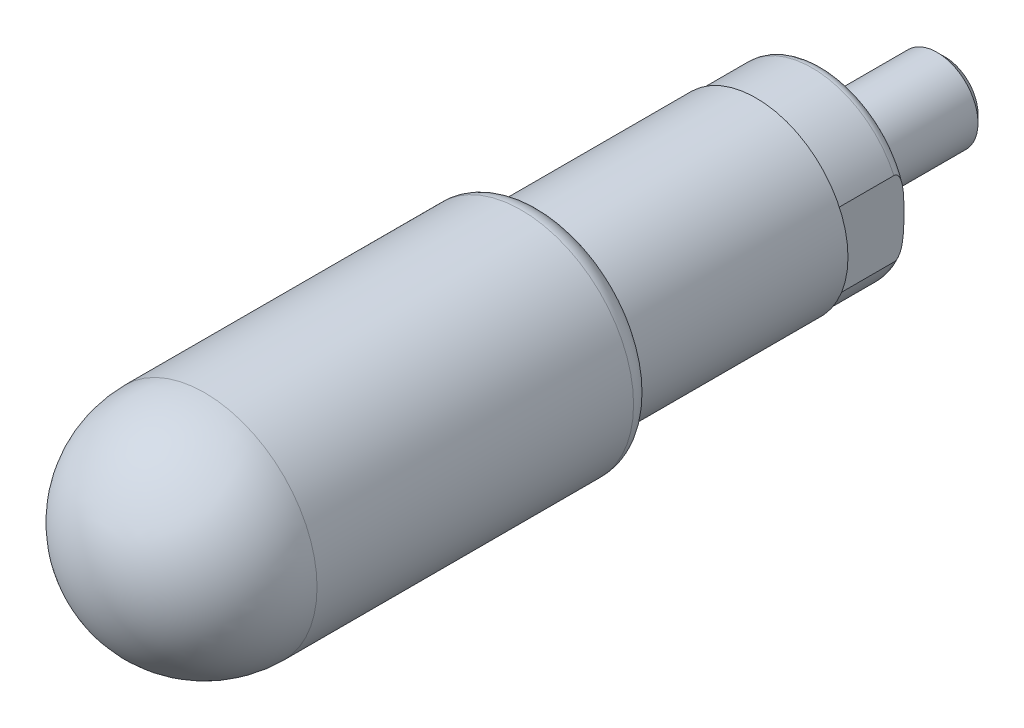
ISO-10303-21;
HEADER;
FILE_DESCRIPTION(('STEP AP214'),'2;1');
FILE_NAME('part.step','',(''),(''),'','','');
FILE_SCHEMA(('AUTOMOTIVE_DESIGN { 1 0 10303 214 1 1 1 1 }'));
ENDSEC;
DATA;
#1=APPLICATION_CONTEXT('core data for automotive mechanical design processes');
#2=APPLICATION_PROTOCOL_DEFINITION('international standard','automotive_design',2000,#1);
#3=PRODUCT_CONTEXT('',#1,'mechanical');
#4=PRODUCT('Part','Part','',(#3));
#5=PRODUCT_RELATED_PRODUCT_CATEGORY('part','',(#4));
#6=PRODUCT_DEFINITION_FORMATION('','',#4);
#7=PRODUCT_DEFINITION_CONTEXT('part definition',#1,'design');
#8=PRODUCT_DEFINITION('design','',#6,#7);
#9=PRODUCT_DEFINITION_SHAPE('','',#8);
#10=(LENGTH_UNIT() NAMED_UNIT(*) SI_UNIT(.MILLI.,.METRE.));
#11=(NAMED_UNIT(*) PLANE_ANGLE_UNIT() SI_UNIT($,.RADIAN.));
#12=(NAMED_UNIT(*) SI_UNIT($,.STERADIAN.) SOLID_ANGLE_UNIT());
#13=UNCERTAINTY_MEASURE_WITH_UNIT(LENGTH_MEASURE(1.E-05),#10,'distance_accuracy_value','');
#14=(GEOMETRIC_REPRESENTATION_CONTEXT(3) GLOBAL_UNCERTAINTY_ASSIGNED_CONTEXT((#13)) GLOBAL_UNIT_ASSIGNED_CONTEXT((#10,
#11,#12)) REPRESENTATION_CONTEXT('',''));
#15=CARTESIAN_POINT('',(0.,0.,0.));
#16=DIRECTION('',(0.,0.,1.));
#17=DIRECTION('',(1.,0.,0.));
#18=AXIS2_PLACEMENT_3D('',#15,#16,#17);
#19=CARTESIAN_POINT('',(0.,0.,1.));
#20=DIRECTION('',(0.,0.,1.));
#21=DIRECTION('',(1.,0.,0.));
#22=AXIS2_PLACEMENT_3D('',#19,#20,#21);
#23=TOROIDAL_SURFACE('',#22,7.8,1.);
#24=CARTESIAN_POINT('',(0.,0.,0.));
#25=DIRECTION('',(0.,0.,1.));
#26=DIRECTION('',(1.,0.,0.));
#27=AXIS2_PLACEMENT_3D('',#24,#25,#26);
#28=CIRCLE('',#27,7.8);
#29=CARTESIAN_POINT('',(7.8,0.,0.));
#30=VERTEX_POINT('',#29);
#31=EDGE_CURVE('E80',#30,#30,#28,.T.);
#32=ORIENTED_EDGE('',*,*,#31,.T.);
#33=EDGE_LOOP('',(#32));
#34=FACE_BOUND('',#33,.T.);
#35=CARTESIAN_POINT('',(0.,0.,1.));
#36=DIRECTION('',(0.,0.,1.));
#37=DIRECTION('',(1.,0.,0.));
#38=AXIS2_PLACEMENT_3D('',#35,#36,#37);
#39=CIRCLE('',#38,8.8);
#40=CARTESIAN_POINT('',(-8.,-3.66606055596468,1.));
#41=VERTEX_POINT('',#40);
#42=CARTESIAN_POINT('',(8.,-3.66606055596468,1.));
#43=VERTEX_POINT('',#42);
#44=EDGE_CURVE('E71',#41,#43,#39,.T.);
#45=ORIENTED_EDGE('',*,*,#44,.F.);
#46=CARTESIAN_POINT('',(-8.,0.,0.0202041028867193));
#47=CARTESIAN_POINT('',(-8.,0.167037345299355,0.0201982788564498));
#48=CARTESIAN_POINT('',(-8.,0.334076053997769,0.021227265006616));
#49=CARTESIAN_POINT('',(-8.,0.668199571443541,0.025844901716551));
#50=CARTESIAN_POINT('',(-8.,0.835284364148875,0.0294347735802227));
#51=CARTESIAN_POINT('',(-8.,1.16900530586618,0.0407143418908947));
#52=CARTESIAN_POINT('',(-8.,1.33564168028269,0.0483957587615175));
#53=CARTESIAN_POINT('',(-8.,1.58522055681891,0.0650469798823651));
#54=CARTESIAN_POINT('',(-8.,1.66833078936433,0.0714500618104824));
#55=CARTESIAN_POINT('',(-8.,1.83434904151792,0.086459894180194));
#56=CARTESIAN_POINT('',(-8.,1.91725707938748,0.0950664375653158));
#57=CARTESIAN_POINT('',(-8.,2.08329165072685,0.115144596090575));
#58=CARTESIAN_POINT('',(-8.,2.16641598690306,0.126634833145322));
#59=CARTESIAN_POINT('',(-8.,2.33213435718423,0.153240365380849));
#60=CARTESIAN_POINT('',(-8.,2.41472812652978,0.168357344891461));
#61=CARTESIAN_POINT('',(-8.,2.57902432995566,0.20325919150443));
#62=CARTESIAN_POINT('',(-8.,2.66072597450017,0.223047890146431));
#63=CARTESIAN_POINT('',(-8.,2.82235632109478,0.268676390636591));
#64=CARTESIAN_POINT('',(-8.,2.90228681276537,0.294509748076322));
#65=CARTESIAN_POINT('',(-8.,3.05996648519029,0.354566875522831));
#66=CARTESIAN_POINT('',(-8.,3.13768852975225,0.388866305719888));
#67=CARTESIAN_POINT('',(-8.,3.2495147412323,0.448779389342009));
#68=CARTESIAN_POINT('',(-8.,3.28591135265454,0.47009664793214));
#69=CARTESIAN_POINT('',(-8.,3.35648206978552,0.516107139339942));
#70=CARTESIAN_POINT('',(-8.,3.39065927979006,0.540795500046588));
#71=CARTESIAN_POINT('',(-8.,3.44809219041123,0.58789922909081));
#72=CARTESIAN_POINT('',(-8.,3.47202524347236,0.609482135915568));
#73=CARTESIAN_POINT('',(-8.,3.51728442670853,0.655315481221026));
#74=CARTESIAN_POINT('',(-8.,3.53860784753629,0.679568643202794));
#75=CARTESIAN_POINT('',(-8.,3.57781054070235,0.73121629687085));
#76=CARTESIAN_POINT('',(-8.,3.59564701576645,0.758643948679));
#77=CARTESIAN_POINT('',(-8.,3.62609205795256,0.816262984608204));
#78=CARTESIAN_POINT('',(-8.,3.63871463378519,0.846446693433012));
#79=CARTESIAN_POINT('',(-8.,3.65481682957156,0.900618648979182));
#80=CARTESIAN_POINT('',(-8.,3.65982727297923,0.92415116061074));
#81=CARTESIAN_POINT('',(-8.,3.66578100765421,0.971725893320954));
#82=CARTESIAN_POINT('',(-8.,3.66672684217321,0.995767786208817));
#83=CARTESIAN_POINT('',(-8.,3.66446179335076,1.04364842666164));
#84=CARTESIAN_POINT('',(-8.,3.66125123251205,1.06748718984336));
#85=CARTESIAN_POINT('',(-8.,3.65097203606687,1.11431444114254));
#86=CARTESIAN_POINT('',(-8.,3.6439005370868,1.13730228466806));
#87=CARTESIAN_POINT('',(-8.,3.6237330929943,1.18889305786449));
#88=CARTESIAN_POINT('',(-8.,3.60944939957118,1.21702889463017));
#89=CARTESIAN_POINT('',(-8.,3.57655994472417,1.2706424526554));
#90=CARTESIAN_POINT('',(-8.,3.55794485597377,1.29611426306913));
#91=CARTESIAN_POINT('',(-8.,3.50593875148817,1.35833896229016));
#92=CARTESIAN_POINT('',(-8.,3.4702176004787,1.39312593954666));
#93=CARTESIAN_POINT('',(-8.,3.39409078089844,1.45704748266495));
#94=CARTESIAN_POINT('',(-8.,3.3536745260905,1.48616886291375));
#95=CARTESIAN_POINT('',(-8.,3.2707096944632,1.53926623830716));
#96=CARTESIAN_POINT('',(-8.,3.22821550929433,1.56332869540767));
#97=CARTESIAN_POINT('',(-8.,3.14133927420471,1.60781154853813));
#98=CARTESIAN_POINT('',(-8.,3.09695532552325,1.62822816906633));
#99=CARTESIAN_POINT('',(-8.,3.00681902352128,1.66607727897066));
#100=CARTESIAN_POINT('',(-8.,2.96106355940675,1.68350226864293));
#101=CARTESIAN_POINT('',(-8.,2.86870159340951,1.71578898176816));
#102=CARTESIAN_POINT('',(-8.,2.82209565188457,1.7306523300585));
#103=CARTESIAN_POINT('',(-8.,2.67135475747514,1.77497605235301));
#104=CARTESIAN_POINT('',(-8.,2.56599820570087,1.80027834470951));
#105=CARTESIAN_POINT('',(-8.,2.35375355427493,1.84350070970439));
#106=CARTESIAN_POINT('',(-8.,2.24686384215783,1.86141231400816));
#107=CARTESIAN_POINT('',(-8.,2.03192417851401,1.89189332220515));
#108=CARTESIAN_POINT('',(-8.,1.9238713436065,1.90444187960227));
#109=CARTESIAN_POINT('',(-8.,1.70744551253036,1.92556023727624));
#110=CARTESIAN_POINT('',(-8.,1.59907268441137,1.93413184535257));
#111=CARTESIAN_POINT('',(-8.,1.38153095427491,1.94842696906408));
#112=CARTESIAN_POINT('',(-8.,1.2723610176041,1.95413409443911));
#113=CARTESIAN_POINT('',(-8.,1.05392865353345,1.96344667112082));
#114=CARTESIAN_POINT('',(-8.,0.944666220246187,1.96705197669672));
#115=CARTESIAN_POINT('',(-8.,0.726074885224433,1.97275132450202));
#116=CARTESIAN_POINT('',(-8.,0.616745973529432,1.97484496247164));
#117=CARTESIAN_POINT('',(-8.,0.398076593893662,1.97790835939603));
#118=CARTESIAN_POINT('',(-8.,0.288736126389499,1.9788781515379));
#119=CARTESIAN_POINT('',(-8.,0.0850536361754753,1.97981900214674));
#120=CARTESIAN_POINT('',(-8.,-0.0092878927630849,1.97990883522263));
#121=CARTESIAN_POINT('',(-8.,-0.197958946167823,1.97940851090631));
#122=CARTESIAN_POINT('',(-8.,-0.292288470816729,1.97881842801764));
#123=CARTESIAN_POINT('',(-8.,-0.481026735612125,1.97686801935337));
#124=CARTESIAN_POINT('',(-8.,-0.575435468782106,1.97550698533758));
#125=CARTESIAN_POINT('',(-8.,-0.764236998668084,1.97181829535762));
#126=CARTESIAN_POINT('',(-8.,-0.858629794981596,1.96949061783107));
#127=CARTESIAN_POINT('',(-8.,-1.04744245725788,1.96356207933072));
#128=CARTESIAN_POINT('',(-8.,-1.14186229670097,1.95996033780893));
#129=CARTESIAN_POINT('',(-8.,-1.33062130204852,1.95106205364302));
#130=CARTESIAN_POINT('',(-8.,-1.42496047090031,1.94576557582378));
#131=CARTESIAN_POINT('',(-8.,-1.61340050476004,1.93292942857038));
#132=CARTESIAN_POINT('',(-8.,-1.7075015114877,1.92539191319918));
#133=CARTESIAN_POINT('',(-8.,-1.89541333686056,1.90735887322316));
#134=CARTESIAN_POINT('',(-8.,-1.98922419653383,1.89686378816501));
#135=CARTESIAN_POINT('',(-8.,-2.17781126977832,1.87179419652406));
#136=CARTESIAN_POINT('',(-8.,-2.2725796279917,1.85715844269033));
#137=CARTESIAN_POINT('',(-8.,-2.46128941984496,1.82256033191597));
#138=CARTESIAN_POINT('',(-8.,-2.5552295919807,1.80259094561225));
#139=CARTESIAN_POINT('',(-8.,-2.74062234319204,1.75571655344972));
#140=CARTESIAN_POINT('',(-8.,-2.83208917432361,1.72887109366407));
#141=CARTESIAN_POINT('',(-8.,-2.96664277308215,1.6813936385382));
#142=CARTESIAN_POINT('',(-8.,-3.01100611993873,1.66438863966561));
#143=CARTESIAN_POINT('',(-8.,-3.0985098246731,1.62750114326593));
#144=CARTESIAN_POINT('',(-8.,-3.14165081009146,1.6076201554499));
#145=CARTESIAN_POINT('',(-8.,-3.2303638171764,1.56226308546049));
#146=CARTESIAN_POINT('',(-8.,-3.27575538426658,1.53642840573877));
#147=CARTESIAN_POINT('',(-8.,-3.36325476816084,1.47957009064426));
#148=CARTESIAN_POINT('',(-8.,-3.4053639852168,1.4485486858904));
#149=CARTESIAN_POINT('',(-8.,-3.47301762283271,1.38977207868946));
#150=CARTESIAN_POINT('',(-8.,-3.49988675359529,1.36355852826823));
#151=CARTESIAN_POINT('',(-8.,-3.54946117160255,1.30742234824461));
#152=CARTESIAN_POINT('',(-8.,-3.57217419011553,1.27750678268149));
#153=CARTESIAN_POINT('',(-8.,-3.60597944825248,1.22287515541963));
#154=CARTESIAN_POINT('',(-8.,-3.61854197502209,1.19907712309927));
#155=CARTESIAN_POINT('',(-8.,-3.63968147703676,1.14976209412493));
#156=CARTESIAN_POINT('',(-8.,-3.64826276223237,1.124246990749));
#157=CARTESIAN_POINT('',(-8.,-3.66070206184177,1.07182507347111));
#158=CARTESIAN_POINT('',(-8.,-3.66451808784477,1.04490803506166));
#159=CARTESIAN_POINT('',(-8.,-3.66683579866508,0.990845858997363));
#160=CARTESIAN_POINT('',(-8.,-3.66533934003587,0.963700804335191));
#161=CARTESIAN_POINT('',(-8.,-3.65772462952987,0.913494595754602));
#162=CARTESIAN_POINT('',(-8.,-3.65219451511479,0.890340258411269));
#163=CARTESIAN_POINT('',(-8.,-3.63765802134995,0.845161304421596));
#164=CARTESIAN_POINT('',(-8.,-3.6286501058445,0.823137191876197));
#165=CARTESIAN_POINT('',(-8.,-3.60296476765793,0.770784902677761));
#166=CARTESIAN_POINT('',(-8.,-3.58466344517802,0.741256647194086));
#167=CARTESIAN_POINT('',(-8.,-3.54364555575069,0.685448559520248));
#168=CARTESIAN_POINT('',(-8.,-3.52091751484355,0.659177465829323));
#169=CARTESIAN_POINT('',(-8.,-3.45626036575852,0.593231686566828));
#170=CARTESIAN_POINT('',(-8.,-3.41160881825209,0.55625228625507));
#171=CARTESIAN_POINT('',(-8.,-3.31752375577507,0.489099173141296));
#172=CARTESIAN_POINT('',(-8.,-3.26807885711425,0.45894225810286));
#173=CARTESIAN_POINT('',(-8.,-3.16427060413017,0.402901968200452));
#174=CARTESIAN_POINT('',(-8.,-3.10978918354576,0.377240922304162));
#175=CARTESIAN_POINT('',(-8.,-2.99886609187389,0.330506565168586));
#176=CARTESIAN_POINT('',(-8.,-2.94242227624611,0.309438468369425));
#177=CARTESIAN_POINT('',(-8.,-2.82816237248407,0.270965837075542));
#178=CARTESIAN_POINT('',(-8.,-2.7703432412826,0.253570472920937));
#179=CARTESIAN_POINT('',(-8.,-2.65392295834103,0.221837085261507));
#180=CARTESIAN_POINT('',(-8.,-2.59532229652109,0.207497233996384));
#181=CARTESIAN_POINT('',(-8.,-2.43319827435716,0.171453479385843));
#182=CARTESIAN_POINT('',(-8.,-2.3291009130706,0.152343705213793));
#183=CARTESIAN_POINT('',(-8.,-2.12001802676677,0.119704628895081));
#184=CARTESIAN_POINT('',(-8.,-2.01503200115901,0.106178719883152));
#185=CARTESIAN_POINT('',(-8.,-1.80440944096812,0.0832296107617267));
#186=CARTESIAN_POINT('',(-8.,-1.69877201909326,0.0738147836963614));
#187=CARTESIAN_POINT('',(-8.,-1.48726787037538,0.0580262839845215));
#188=CARTESIAN_POINT('',(-8.,-1.38140111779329,0.0516529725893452));
#189=CARTESIAN_POINT('',(-8.,-1.1692274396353,0.0411075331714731));
#190=CARTESIAN_POINT('',(-8.,-1.06292017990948,0.0369424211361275));
#191=CARTESIAN_POINT('',(-8.,-0.850252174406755,0.0302284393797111));
#192=CARTESIAN_POINT('',(-8.,-0.743891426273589,0.0276796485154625));
#193=CARTESIAN_POINT('',(-8.,-0.531278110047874,0.0237724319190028));
#194=CARTESIAN_POINT('',(-8.,-0.425025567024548,0.0224125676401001));
#195=CARTESIAN_POINT('',(-8.,-0.21251553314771,0.0206302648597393));
#196=CARTESIAN_POINT('',(-8.,-0.106258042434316,0.0202078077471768));
#197=CARTESIAN_POINT('',(-8.,0.,0.0202041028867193));
#198=B_SPLINE_CURVE_WITH_KNOTS('',3,(#46,#47,#48,#49,#50,#51,#52,#53,#54,#55,#56,#57,#58,#59,
#60,#61,#62,#63,#64,#65,#66,#67,#68,#69,#70,#71,#72,#73,#74,#75,#76,#77,#78,#79,#80,#81,#82,#83,
#84,#85,#86,#87,#88,#89,#90,#91,#92,#93,#94,#95,#96,#97,#98,#99,#100,#101,#102,#103,#104,#105,
#106,#107,#108,#109,#110,#111,#112,#113,#114,#115,#116,#117,#118,#119,#120,#121,#122,#123,#124,
#125,#126,#127,#128,#129,#130,#131,#132,#133,#134,#135,#136,#137,#138,#139,#140,#141,#142,#143,
#144,#145,#146,#147,#148,#149,#150,#151,#152,#153,#154,#155,#156,#157,#158,#159,#160,#161,#162,
#163,#164,#165,#166,#167,#168,#169,#170,#171,#172,#173,#174,#175,#176,#177,#178,#179,#180,#181,
#182,#183,#184,#185,#186,#187,#188,#189,#190,#191,#192,#193,#194,#195,#196,#197),.UNSPECIFIED.,
.T.,.F.,(4,2,2,2,2,2,2,2,2,2,2,2,2,2,2,2,2,2,2,2,2,2,2,2,2,2,2,2,2,2,2,2,2,2,2,2,2,2,2,2,2,2,2,
2,2,2,2,2,2,2,2,2,2,2,2,2,2,2,2,2,2,2,2,2,2,2,2,2,2,2,2,2,2,2,2,4),(0.,0.501109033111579,
1.00245720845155,1.50279469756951,1.75284217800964,2.0028661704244,2.25454825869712,
2.50634746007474,2.75835389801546,3.01009287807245,3.26416869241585,3.39056966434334,
3.51678985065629,3.61330504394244,3.7099196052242,3.80765430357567,3.90512467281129,
3.9769868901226,4.04880413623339,4.12061581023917,4.19248081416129,4.28661263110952,
4.38094906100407,4.52969046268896,4.67877399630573,4.8250539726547,4.97148456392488,
5.11827704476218,5.2649760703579,5.58958549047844,5.91456582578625,6.24079813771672,
6.56688200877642,6.89481101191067,7.22276274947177,7.5508021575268,7.87883187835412,
8.16185432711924,8.44484576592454,8.72809759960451,9.01135575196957,9.29481005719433,
9.57825352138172,9.86142541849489,10.1445552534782,10.4321141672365,10.7200539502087,
11.0055798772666,11.1480337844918,11.2904131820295,11.4468485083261,11.6032167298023,
11.7155355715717,11.8276433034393,11.9080859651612,11.9884413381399,12.0694998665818,
12.1505300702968,12.2216420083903,12.2927853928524,12.3964121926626,12.5003112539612,
12.673259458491,12.8466289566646,13.0270143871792,13.2076035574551,13.3886384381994,
13.5695647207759,13.8868356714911,14.2042991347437,14.5224061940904,14.8405510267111,
15.159700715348,15.4788659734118,15.7976445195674,16.1164167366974),.UNSPECIFIED.);
#199=CARTESIAN_POINT('',(-8.,3.66606055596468,1.));
#200=VERTEX_POINT('',#199);
#201=EDGE_CURVE('E66',#41,#200,#198,.T.);
#202=ORIENTED_EDGE('',*,*,#201,.T.);
#203=CARTESIAN_POINT('',(8.,3.66606055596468,1.));
#204=VERTEX_POINT('',#203);
#205=EDGE_CURVE('E65',#204,#200,#39,.T.);
#206=ORIENTED_EDGE('',*,*,#205,.F.);
#207=CARTESIAN_POINT('',(8.,0.,0.0202041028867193));
#208=CARTESIAN_POINT('',(8.,-0.167037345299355,0.0201982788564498));
#209=CARTESIAN_POINT('',(8.,-0.334076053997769,0.021227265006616));
#210=CARTESIAN_POINT('',(8.,-0.668199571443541,0.025844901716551));
#211=CARTESIAN_POINT('',(8.,-0.835284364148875,0.0294347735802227));
#212=CARTESIAN_POINT('',(8.,-1.16900530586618,0.0407143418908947));
#213=CARTESIAN_POINT('',(8.,-1.33564168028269,0.0483957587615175));
#214=CARTESIAN_POINT('',(8.,-1.58522055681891,0.0650469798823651));
#215=CARTESIAN_POINT('',(8.,-1.66833078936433,0.0714500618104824));
#216=CARTESIAN_POINT('',(8.,-1.83434904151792,0.086459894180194));
#217=CARTESIAN_POINT('',(8.,-1.91725707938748,0.0950664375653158));
#218=CARTESIAN_POINT('',(8.,-2.08329165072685,0.115144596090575));
#219=CARTESIAN_POINT('',(8.,-2.16641598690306,0.126634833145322));
#220=CARTESIAN_POINT('',(8.,-2.33213435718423,0.153240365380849));
#221=CARTESIAN_POINT('',(8.,-2.41472812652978,0.168357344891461));
#222=CARTESIAN_POINT('',(8.,-2.57902432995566,0.20325919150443));
#223=CARTESIAN_POINT('',(8.,-2.66072597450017,0.223047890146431));
#224=CARTESIAN_POINT('',(8.,-2.82235632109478,0.268676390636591));
#225=CARTESIAN_POINT('',(8.,-2.90228681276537,0.294509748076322));
#226=CARTESIAN_POINT('',(8.,-3.05996648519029,0.354566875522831));
#227=CARTESIAN_POINT('',(8.,-3.13768852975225,0.388866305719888));
#228=CARTESIAN_POINT('',(8.,-3.2495147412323,0.448779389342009));
#229=CARTESIAN_POINT('',(8.,-3.28591135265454,0.47009664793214));
#230=CARTESIAN_POINT('',(8.,-3.35648206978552,0.516107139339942));
#231=CARTESIAN_POINT('',(8.,-3.39065927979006,0.540795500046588));
#232=CARTESIAN_POINT('',(8.,-3.44809219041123,0.58789922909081));
#233=CARTESIAN_POINT('',(8.,-3.47202524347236,0.609482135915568));
#234=CARTESIAN_POINT('',(8.,-3.51728442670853,0.655315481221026));
#235=CARTESIAN_POINT('',(8.,-3.53860784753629,0.679568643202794));
#236=CARTESIAN_POINT('',(8.,-3.57781054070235,0.73121629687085));
#237=CARTESIAN_POINT('',(8.,-3.59564701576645,0.758643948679));
#238=CARTESIAN_POINT('',(8.,-3.62609205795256,0.816262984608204));
#239=CARTESIAN_POINT('',(8.,-3.63871463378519,0.846446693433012));
#240=CARTESIAN_POINT('',(8.,-3.65481682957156,0.900618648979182));
#241=CARTESIAN_POINT('',(8.,-3.65982727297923,0.92415116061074));
#242=CARTESIAN_POINT('',(8.,-3.66578100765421,0.971725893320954));
#243=CARTESIAN_POINT('',(8.,-3.66672684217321,0.995767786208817));
#244=CARTESIAN_POINT('',(8.,-3.66446179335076,1.04364842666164));
#245=CARTESIAN_POINT('',(8.,-3.66125123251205,1.06748718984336));
#246=CARTESIAN_POINT('',(8.,-3.65097203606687,1.11431444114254));
#247=CARTESIAN_POINT('',(8.,-3.6439005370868,1.13730228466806));
#248=CARTESIAN_POINT('',(8.,-3.6237330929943,1.18889305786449));
#249=CARTESIAN_POINT('',(8.,-3.60944939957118,1.21702889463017));
#250=CARTESIAN_POINT('',(8.,-3.57655994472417,1.2706424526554));
#251=CARTESIAN_POINT('',(8.,-3.55794485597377,1.29611426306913));
#252=CARTESIAN_POINT('',(8.,-3.50593875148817,1.35833896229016));
#253=CARTESIAN_POINT('',(8.,-3.4702176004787,1.39312593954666));
#254=CARTESIAN_POINT('',(8.,-3.39409078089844,1.45704748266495));
#255=CARTESIAN_POINT('',(8.,-3.3536745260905,1.48616886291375));
#256=CARTESIAN_POINT('',(8.,-3.2707096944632,1.53926623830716));
#257=CARTESIAN_POINT('',(8.,-3.22821550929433,1.56332869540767));
#258=CARTESIAN_POINT('',(8.,-3.14133927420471,1.60781154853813));
#259=CARTESIAN_POINT('',(8.,-3.09695532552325,1.62822816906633));
#260=CARTESIAN_POINT('',(8.,-3.00681902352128,1.66607727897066));
#261=CARTESIAN_POINT('',(8.,-2.96106355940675,1.68350226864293));
#262=CARTESIAN_POINT('',(8.,-2.86870159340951,1.71578898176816));
#263=CARTESIAN_POINT('',(8.,-2.82209565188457,1.7306523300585));
#264=CARTESIAN_POINT('',(8.,-2.67135475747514,1.77497605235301));
#265=CARTESIAN_POINT('',(8.,-2.56599820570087,1.80027834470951));
#266=CARTESIAN_POINT('',(8.,-2.35375355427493,1.84350070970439));
#267=CARTESIAN_POINT('',(8.,-2.24686384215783,1.86141231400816));
#268=CARTESIAN_POINT('',(8.,-2.03192417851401,1.89189332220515));
#269=CARTESIAN_POINT('',(8.,-1.9238713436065,1.90444187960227));
#270=CARTESIAN_POINT('',(8.,-1.70744551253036,1.92556023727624));
#271=CARTESIAN_POINT('',(8.,-1.59907268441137,1.93413184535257));
#272=CARTESIAN_POINT('',(8.,-1.38153095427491,1.94842696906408));
#273=CARTESIAN_POINT('',(8.,-1.2723610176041,1.95413409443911));
#274=CARTESIAN_POINT('',(8.,-1.05392865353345,1.96344667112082));
#275=CARTESIAN_POINT('',(8.,-0.944666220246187,1.96705197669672));
#276=CARTESIAN_POINT('',(8.,-0.726074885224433,1.97275132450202));
#277=CARTESIAN_POINT('',(8.,-0.616745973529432,1.97484496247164));
#278=CARTESIAN_POINT('',(8.,-0.398076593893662,1.97790835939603));
#279=CARTESIAN_POINT('',(8.,-0.288736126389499,1.9788781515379));
#280=CARTESIAN_POINT('',(8.,-0.0850536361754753,1.97981900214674));
#281=CARTESIAN_POINT('',(8.,0.0092878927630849,1.97990883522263));
#282=CARTESIAN_POINT('',(8.,0.197958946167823,1.97940851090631));
#283=CARTESIAN_POINT('',(8.,0.292288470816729,1.97881842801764));
#284=CARTESIAN_POINT('',(8.,0.481026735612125,1.97686801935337));
#285=CARTESIAN_POINT('',(8.,0.575435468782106,1.97550698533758));
#286=CARTESIAN_POINT('',(8.,0.764236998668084,1.97181829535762));
#287=CARTESIAN_POINT('',(8.,0.858629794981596,1.96949061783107));
#288=CARTESIAN_POINT('',(8.,1.04744245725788,1.96356207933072));
#289=CARTESIAN_POINT('',(8.,1.14186229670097,1.95996033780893));
#290=CARTESIAN_POINT('',(8.,1.33062130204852,1.95106205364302));
#291=CARTESIAN_POINT('',(8.,1.42496047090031,1.94576557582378));
#292=CARTESIAN_POINT('',(8.,1.61340050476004,1.93292942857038));
#293=CARTESIAN_POINT('',(8.,1.7075015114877,1.92539191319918));
#294=CARTESIAN_POINT('',(8.,1.89541333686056,1.90735887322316));
#295=CARTESIAN_POINT('',(8.,1.98922419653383,1.89686378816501));
#296=CARTESIAN_POINT('',(8.,2.17781126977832,1.87179419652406));
#297=CARTESIAN_POINT('',(8.,2.2725796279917,1.85715844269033));
#298=CARTESIAN_POINT('',(8.,2.46128941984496,1.82256033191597));
#299=CARTESIAN_POINT('',(8.,2.5552295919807,1.80259094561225));
#300=CARTESIAN_POINT('',(8.,2.74062234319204,1.75571655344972));
#301=CARTESIAN_POINT('',(8.,2.83208917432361,1.72887109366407));
#302=CARTESIAN_POINT('',(8.,2.96664277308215,1.6813936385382));
#303=CARTESIAN_POINT('',(8.,3.01100611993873,1.66438863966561));
#304=CARTESIAN_POINT('',(8.,3.0985098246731,1.62750114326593));
#305=CARTESIAN_POINT('',(8.,3.14165081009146,1.6076201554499));
#306=CARTESIAN_POINT('',(8.,3.2303638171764,1.56226308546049));
#307=CARTESIAN_POINT('',(8.,3.27575538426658,1.53642840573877));
#308=CARTESIAN_POINT('',(8.,3.36325476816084,1.47957009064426));
#309=CARTESIAN_POINT('',(8.,3.4053639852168,1.4485486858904));
#310=CARTESIAN_POINT('',(8.,3.47301762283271,1.38977207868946));
#311=CARTESIAN_POINT('',(8.,3.49988675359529,1.36355852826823));
#312=CARTESIAN_POINT('',(8.,3.54946117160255,1.30742234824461));
#313=CARTESIAN_POINT('',(8.,3.57217419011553,1.27750678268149));
#314=CARTESIAN_POINT('',(8.,3.60597944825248,1.22287515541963));
#315=CARTESIAN_POINT('',(8.,3.61854197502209,1.19907712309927));
#316=CARTESIAN_POINT('',(8.,3.63968147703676,1.14976209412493));
#317=CARTESIAN_POINT('',(8.,3.64826276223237,1.124246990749));
#318=CARTESIAN_POINT('',(8.,3.66070206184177,1.07182507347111));
#319=CARTESIAN_POINT('',(8.,3.66451808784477,1.04490803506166));
#320=CARTESIAN_POINT('',(8.,3.66683579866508,0.990845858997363));
#321=CARTESIAN_POINT('',(8.,3.66533934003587,0.963700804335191));
#322=CARTESIAN_POINT('',(8.,3.65772462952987,0.913494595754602));
#323=CARTESIAN_POINT('',(8.,3.65219451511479,0.890340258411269));
#324=CARTESIAN_POINT('',(8.,3.63765802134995,0.845161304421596));
#325=CARTESIAN_POINT('',(8.,3.6286501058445,0.823137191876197));
#326=CARTESIAN_POINT('',(8.,3.60296476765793,0.770784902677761));
#327=CARTESIAN_POINT('',(8.,3.58466344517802,0.741256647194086));
#328=CARTESIAN_POINT('',(8.,3.54364555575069,0.685448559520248));
#329=CARTESIAN_POINT('',(8.,3.52091751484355,0.659177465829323));
#330=CARTESIAN_POINT('',(8.,3.45626036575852,0.593231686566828));
#331=CARTESIAN_POINT('',(8.,3.41160881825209,0.55625228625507));
#332=CARTESIAN_POINT('',(8.,3.31752375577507,0.489099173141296));
#333=CARTESIAN_POINT('',(8.,3.26807885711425,0.45894225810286));
#334=CARTESIAN_POINT('',(8.,3.16427060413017,0.402901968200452));
#335=CARTESIAN_POINT('',(8.,3.10978918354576,0.377240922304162));
#336=CARTESIAN_POINT('',(8.,2.99886609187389,0.330506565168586));
#337=CARTESIAN_POINT('',(8.,2.94242227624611,0.309438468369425));
#338=CARTESIAN_POINT('',(8.,2.82816237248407,0.270965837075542));
#339=CARTESIAN_POINT('',(8.,2.7703432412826,0.253570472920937));
#340=CARTESIAN_POINT('',(8.,2.65392295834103,0.221837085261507));
#341=CARTESIAN_POINT('',(8.,2.59532229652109,0.207497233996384));
#342=CARTESIAN_POINT('',(8.,2.43319827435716,0.171453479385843));
#343=CARTESIAN_POINT('',(8.,2.3291009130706,0.152343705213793));
#344=CARTESIAN_POINT('',(8.,2.12001802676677,0.119704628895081));
#345=CARTESIAN_POINT('',(8.,2.01503200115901,0.106178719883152));
#346=CARTESIAN_POINT('',(8.,1.80440944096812,0.0832296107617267));
#347=CARTESIAN_POINT('',(8.,1.69877201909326,0.0738147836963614));
#348=CARTESIAN_POINT('',(8.,1.48726787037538,0.0580262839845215));
#349=CARTESIAN_POINT('',(8.,1.38140111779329,0.0516529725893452));
#350=CARTESIAN_POINT('',(8.,1.1692274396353,0.0411075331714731));
#351=CARTESIAN_POINT('',(8.,1.06292017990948,0.0369424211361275));
#352=CARTESIAN_POINT('',(8.,0.850252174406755,0.0302284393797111));
#353=CARTESIAN_POINT('',(8.,0.743891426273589,0.0276796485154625));
#354=CARTESIAN_POINT('',(8.,0.531278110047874,0.0237724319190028));
#355=CARTESIAN_POINT('',(8.,0.425025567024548,0.0224125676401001));
#356=CARTESIAN_POINT('',(8.,0.21251553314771,0.0206302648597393));
#357=CARTESIAN_POINT('',(8.,0.106258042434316,0.0202078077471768));
#358=CARTESIAN_POINT('',(8.,0.,0.0202041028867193));
#359=B_SPLINE_CURVE_WITH_KNOTS('',3,(#207,#208,#209,#210,#211,#212,#213,#214,#215,#216,#217,
#218,#219,#220,#221,#222,#223,#224,#225,#226,#227,#228,#229,#230,#231,#232,#233,#234,#235,#236,
#237,#238,#239,#240,#241,#242,#243,#244,#245,#246,#247,#248,#249,#250,#251,#252,#253,#254,#255,
#256,#257,#258,#259,#260,#261,#262,#263,#264,#265,#266,#267,#268,#269,#270,#271,#272,#273,#274,
#275,#276,#277,#278,#279,#280,#281,#282,#283,#284,#285,#286,#287,#288,#289,#290,#291,#292,#293,
#294,#295,#296,#297,#298,#299,#300,#301,#302,#303,#304,#305,#306,#307,#308,#309,#310,#311,#312,
#313,#314,#315,#316,#317,#318,#319,#320,#321,#322,#323,#324,#325,#326,#327,#328,#329,#330,#331,
#332,#333,#334,#335,#336,#337,#338,#339,#340,#341,#342,#343,#344,#345,#346,#347,#348,#349,#350,
#351,#352,#353,#354,#355,#356,#357,#358),.UNSPECIFIED.,.T.,.F.,(4,2,2,2,2,2,2,2,2,2,2,2,2,2,2,2,
2,2,2,2,2,2,2,2,2,2,2,2,2,2,2,2,2,2,2,2,2,2,2,2,2,2,2,2,2,2,2,2,2,2,2,2,2,2,2,2,2,2,2,2,2,2,2,2,
2,2,2,2,2,2,2,2,2,2,2,4),(0.,0.501109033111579,1.00245720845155,1.50279469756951,
1.75284217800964,2.0028661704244,2.25454825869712,2.50634746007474,2.75835389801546,
3.01009287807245,3.26416869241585,3.39056966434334,3.51678985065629,3.61330504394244,
3.7099196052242,3.80765430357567,3.90512467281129,3.9769868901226,4.04880413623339,
4.12061581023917,4.19248081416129,4.28661263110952,4.38094906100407,4.52969046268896,
4.67877399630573,4.8250539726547,4.97148456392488,5.11827704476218,5.2649760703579,
5.58958549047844,5.91456582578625,6.24079813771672,6.56688200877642,6.89481101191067,
7.22276274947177,7.5508021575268,7.87883187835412,8.16185432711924,8.44484576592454,
8.72809759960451,9.01135575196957,9.29481005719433,9.57825352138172,9.86142541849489,
10.1445552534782,10.4321141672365,10.7200539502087,11.0055798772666,11.1480337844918,
11.2904131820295,11.4468485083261,11.6032167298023,11.7155355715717,11.8276433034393,
11.9080859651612,11.9884413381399,12.0694998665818,12.1505300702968,12.2216420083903,
12.2927853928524,12.3964121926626,12.5003112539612,12.673259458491,12.8466289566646,
13.0270143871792,13.2076035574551,13.3886384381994,13.5695647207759,13.8868356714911,
14.2042991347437,14.5224061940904,14.8405510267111,15.159700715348,15.4788659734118,
15.7976445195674,16.1164167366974),.UNSPECIFIED.);
#360=EDGE_CURVE('E123',#204,#43,#359,.T.);
#361=ORIENTED_EDGE('',*,*,#360,.T.);
#362=EDGE_LOOP('',(#45,#202,#206,#361));
#363=FACE_BOUND('',#362,.T.);
#364=ADVANCED_FACE('F14',(#34,#363),#23,.T.);
#365=CARTESIAN_POINT('',(0.,0.,71.5));
#366=DIRECTION('',(0.,0.,1.));
#367=DIRECTION('',(1.,0.,0.));
#368=AXIS2_PLACEMENT_3D('',#365,#366,#367);
#369=CYLINDRICAL_SURFACE('',#368,8.8);
#370=DIRECTION('',(0.,0.,1.));
#371=VECTOR('',#370,1.);
#372=CARTESIAN_POINT('',(-8.,-3.66606055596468,71.5));
#373=LINE('',#372,#371);
#374=CARTESIAN_POINT('',(-8.,-3.66606055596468,6.5));
#375=VERTEX_POINT('',#374);
#376=EDGE_CURVE('E59',#41,#375,#373,.T.);
#377=ORIENTED_EDGE('',*,*,#376,.F.);
#378=ORIENTED_EDGE('',*,*,#44,.T.);
#379=DIRECTION('',(0.,0.,1.));
#380=VECTOR('',#379,1.);
#381=CARTESIAN_POINT('',(8.,-3.66606055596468,71.5));
#382=LINE('',#381,#380);
#383=CARTESIAN_POINT('',(8.,-3.66606055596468,6.5));
#384=VERTEX_POINT('',#383);
#385=EDGE_CURVE('E269',#384,#43,#382,.F.);
#386=ORIENTED_EDGE('',*,*,#385,.F.);
#387=CARTESIAN_POINT('',(0.,0.,6.5));
#388=DIRECTION('',(0.,0.,1.));
#389=DIRECTION('',(1.,0.,0.));
#390=AXIS2_PLACEMENT_3D('',#387,#388,#389);
#391=CIRCLE('',#390,8.8);
#392=EDGE_CURVE('E72',#375,#384,#391,.T.);
#393=ORIENTED_EDGE('',*,*,#392,.F.);
#394=EDGE_LOOP('',(#377,#378,#386,#393));
#395=FACE_BOUND('',#394,.T.);
#396=ADVANCED_FACE('F106',(#395),#369,.T.);
#397=DIRECTION('',(0.,0.,1.));
#398=VECTOR('',#397,1.);
#399=CARTESIAN_POINT('',(8.,3.66606055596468,71.5));
#400=LINE('',#399,#398);
#401=CARTESIAN_POINT('',(8.,3.66606055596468,6.5));
#402=VERTEX_POINT('',#401);
#403=EDGE_CURVE('E67',#204,#402,#400,.T.);
#404=ORIENTED_EDGE('',*,*,#403,.F.);
#405=ORIENTED_EDGE('',*,*,#205,.T.);
#406=DIRECTION('',(0.,0.,1.));
#407=VECTOR('',#406,1.);
#408=CARTESIAN_POINT('',(-8.,3.66606055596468,71.5));
#409=LINE('',#408,#407);
#410=CARTESIAN_POINT('',(-8.,3.66606055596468,6.5));
#411=VERTEX_POINT('',#410);
#412=EDGE_CURVE('E56',#411,#200,#409,.F.);
#413=ORIENTED_EDGE('',*,*,#412,.F.);
#414=EDGE_CURVE('E29',#402,#411,#391,.T.);
#415=ORIENTED_EDGE('',*,*,#414,.F.);
#416=EDGE_LOOP('',(#404,#405,#413,#415));
#417=FACE_BOUND('',#416,.T.);
#418=ADVANCED_FACE('F64',(#417),#369,.T.);
#419=CARTESIAN_POINT('',(0.,0.,-12.));
#420=DIRECTION('',(0.,0.,1.));
#421=DIRECTION('',(1.,0.,0.));
#422=AXIS2_PLACEMENT_3D('',#419,#420,#421);
#423=PLANE('',#422);
#424=CARTESIAN_POINT('',(0.,0.,-12.));
#425=DIRECTION('',(0.,0.,1.));
#426=DIRECTION('',(1.,0.,0.));
#427=AXIS2_PLACEMENT_3D('',#424,#425,#426);
#428=CIRCLE('',#427,3.233);
#429=CARTESIAN_POINT('',(3.233,0.,-12.));
#430=VERTEX_POINT('',#429);
#431=EDGE_CURVE('E9',#430,#430,#428,.T.);
#432=ORIENTED_EDGE('',*,*,#431,.F.);
#433=EDGE_LOOP('',(#432));
#434=FACE_BOUND('',#433,.T.);
#435=ADVANCED_FACE('F16',(#434),#423,.F.);
#436=CARTESIAN_POINT('',(0.,0.,-12.));
#437=DIRECTION('',(0.,0.,1.));
#438=DIRECTION('',(1.,0.,0.));
#439=AXIS2_PLACEMENT_3D('',#436,#437,#438);
#440=CONICAL_SURFACE('',#439,3.233,0.785398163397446);
#441=CARTESIAN_POINT('',(0.,0.,-11.233));
#442=DIRECTION('',(0.,0.,1.));
#443=DIRECTION('',(1.,0.,0.));
#444=AXIS2_PLACEMENT_3D('',#441,#442,#443);
#445=CIRCLE('',#444,4.);
#446=CARTESIAN_POINT('',(4.,0.,-11.233));
#447=VERTEX_POINT('',#446);
#448=EDGE_CURVE('E22',#447,#447,#445,.T.);
#449=ORIENTED_EDGE('',*,*,#448,.F.);
#450=EDGE_LOOP('',(#449));
#451=FACE_BOUND('',#450,.T.);
#452=ORIENTED_EDGE('',*,*,#431,.T.);
#453=EDGE_LOOP('',(#452));
#454=FACE_BOUND('',#453,.T.);
#455=ADVANCED_FACE('F96',(#451,#454),#440,.T.);
#456=CARTESIAN_POINT('',(0.,0.,71.5));
#457=DIRECTION('',(0.,0.,1.));
#458=DIRECTION('',(1.,0.,0.));
#459=AXIS2_PLACEMENT_3D('',#456,#457,#458);
#460=CYLINDRICAL_SURFACE('',#459,4.);
#461=CARTESIAN_POINT('',(0.,0.,-1.967));
#462=DIRECTION('',(0.,0.,1.));
#463=DIRECTION('',(1.,0.,0.));
#464=AXIS2_PLACEMENT_3D('',#461,#462,#463);
#465=CIRCLE('',#464,4.);
#466=CARTESIAN_POINT('',(4.,0.,-1.967));
#467=VERTEX_POINT('',#466);
#468=EDGE_CURVE('E89',#467,#467,#465,.T.);
#469=ORIENTED_EDGE('',*,*,#468,.F.);
#470=EDGE_LOOP('',(#469));
#471=FACE_BOUND('',#470,.T.);
#472=ORIENTED_EDGE('',*,*,#448,.T.);
#473=EDGE_LOOP('',(#472));
#474=FACE_BOUND('',#473,.T.);
#475=ADVANCED_FACE('F94',(#471,#474),#460,.T.);
#476=CARTESIAN_POINT('',(0.,0.,-1.967));
#477=DIRECTION('',(0.,0.,-1.));
#478=DIRECTION('',(-1.,0.,0.));
#479=AXIS2_PLACEMENT_3D('',#476,#477,#478);
#480=CONICAL_SURFACE('',#479,4.,0.785398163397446);
#481=CARTESIAN_POINT('',(0.,0.,-1.2));
#482=DIRECTION('',(0.,0.,1.));
#483=DIRECTION('',(1.,0.,0.));
#484=AXIS2_PLACEMENT_3D('',#481,#482,#483);
#485=CIRCLE('',#484,3.233);
#486=CARTESIAN_POINT('',(3.233,0.,-1.2));
#487=VERTEX_POINT('',#486);
#488=EDGE_CURVE('E86',#487,#487,#485,.T.);
#489=ORIENTED_EDGE('',*,*,#488,.F.);
#490=EDGE_LOOP('',(#489));
#491=FACE_BOUND('',#490,.T.);
#492=ORIENTED_EDGE('',*,*,#468,.T.);
#493=EDGE_LOOP('',(#492));
#494=FACE_BOUND('',#493,.T.);
#495=ADVANCED_FACE('F182',(#491,#494),#480,.T.);
#496=CARTESIAN_POINT('',(0.,0.,71.5));
#497=DIRECTION('',(0.,0.,1.));
#498=DIRECTION('',(1.,0.,0.));
#499=AXIS2_PLACEMENT_3D('',#496,#497,#498);
#500=CYLINDRICAL_SURFACE('',#499,3.233);
#501=CARTESIAN_POINT('',(0.,0.,0.));
#502=DIRECTION('',(0.,0.,1.));
#503=DIRECTION('',(1.,0.,0.));
#504=AXIS2_PLACEMENT_3D('',#501,#502,#503);
#505=CIRCLE('',#504,3.233);
#506=CARTESIAN_POINT('',(3.233,0.,0.));
#507=VERTEX_POINT('',#506);
#508=EDGE_CURVE('E83',#507,#507,#505,.T.);
#509=ORIENTED_EDGE('',*,*,#508,.F.);
#510=EDGE_LOOP('',(#509));
#511=FACE_BOUND('',#510,.T.);
#512=ORIENTED_EDGE('',*,*,#488,.T.);
#513=EDGE_LOOP('',(#512));
#514=FACE_BOUND('',#513,.T.);
#515=ADVANCED_FACE('F162',(#511,#514),#500,.T.);
#516=CARTESIAN_POINT('',(0.,3.233,0.));
#517=DIRECTION('',(0.,0.,1.));
#518=DIRECTION('',(1.,0.,0.));
#519=AXIS2_PLACEMENT_3D('',#516,#517,#518);
#520=PLANE('',#519);
#521=ORIENTED_EDGE('',*,*,#31,.F.);
#522=EDGE_LOOP('',(#521));
#523=FACE_BOUND('',#522,.T.);
#524=ORIENTED_EDGE('',*,*,#508,.T.);
#525=EDGE_LOOP('',(#524));
#526=FACE_BOUND('',#525,.T.);
#527=ADVANCED_FACE('F119',(#523,#526),#520,.F.);
#528=CARTESIAN_POINT('',(0.,8.8,6.5));
#529=DIRECTION('',(0.,0.,1.));
#530=DIRECTION('',(1.,0.,0.));
#531=AXIS2_PLACEMENT_3D('',#528,#529,#530);
#532=PLANE('',#531);
#533=CARTESIAN_POINT('',(0.,0.,6.5));
#534=DIRECTION('',(0.,0.,1.));
#535=DIRECTION('',(1.,0.,0.));
#536=AXIS2_PLACEMENT_3D('',#533,#534,#535);
#537=CIRCLE('',#536,9.);
#538=CARTESIAN_POINT('',(9.,0.,6.5));
#539=VERTEX_POINT('',#538);
#540=EDGE_CURVE('E76',#539,#539,#537,.T.);
#541=ORIENTED_EDGE('',*,*,#540,.F.);
#542=EDGE_LOOP('',(#541));
#543=FACE_BOUND('',#542,.T.);
#544=DIRECTION('',(0.,-1.,0.));
#545=VECTOR('',#544,1.);
#546=CARTESIAN_POINT('',(8.,16.,6.5));
#547=LINE('',#546,#545);
#548=EDGE_CURVE('E61',#402,#384,#547,.T.);
#549=ORIENTED_EDGE('',*,*,#548,.F.);
#550=ORIENTED_EDGE('',*,*,#414,.T.);
#551=DIRECTION('',(0.,1.,0.));
#552=VECTOR('',#551,1.);
#553=CARTESIAN_POINT('',(-8.,-16.,6.5));
#554=LINE('',#553,#552);
#555=EDGE_CURVE('E36',#375,#411,#554,.T.);
#556=ORIENTED_EDGE('',*,*,#555,.F.);
#557=ORIENTED_EDGE('',*,*,#392,.T.);
#558=EDGE_LOOP('',(#549,#550,#556,#557));
#559=FACE_BOUND('',#558,.T.);
#560=ADVANCED_FACE('F69',(#543,#559),#532,.F.);
#561=CARTESIAN_POINT('',(0.,0.,71.5));
#562=DIRECTION('',(0.,0.,1.));
#563=DIRECTION('',(1.,0.,0.));
#564=AXIS2_PLACEMENT_3D('',#561,#562,#563);
#565=CYLINDRICAL_SURFACE('',#564,9.);
#566=CARTESIAN_POINT('',(0.,0.,27.5));
#567=DIRECTION('',(0.,0.,1.));
#568=DIRECTION('',(1.,0.,0.));
#569=AXIS2_PLACEMENT_3D('',#566,#567,#568);
#570=CIRCLE('',#569,9.);
#571=CARTESIAN_POINT('',(9.,0.,27.5));
#572=VERTEX_POINT('',#571);
#573=EDGE_CURVE('E167',#572,#572,#570,.T.);
#574=ORIENTED_EDGE('',*,*,#573,.F.);
#575=EDGE_LOOP('',(#574));
#576=FACE_BOUND('',#575,.T.);
#577=ORIENTED_EDGE('',*,*,#540,.T.);
#578=EDGE_LOOP('',(#577));
#579=FACE_BOUND('',#578,.T.);
#580=ADVANCED_FACE('F153',(#576,#579),#565,.T.);
#581=CARTESIAN_POINT('',(0.,0.,29.5));
#582=DIRECTION('',(0.,0.,1.));
#583=DIRECTION('',(1.,0.,0.));
#584=AXIS2_PLACEMENT_3D('',#581,#582,#583);
#585=TOROIDAL_SURFACE('',#584,9.,2.);
#586=ORIENTED_EDGE('',*,*,#573,.T.);
#587=EDGE_LOOP('',(#586));
#588=FACE_BOUND('',#587,.T.);
#589=CARTESIAN_POINT('',(0.,0.,29.5));
#590=DIRECTION('',(0.,0.,1.));
#591=DIRECTION('',(1.,0.,0.));
#592=AXIS2_PLACEMENT_3D('',#589,#590,#591);
#593=CIRCLE('',#592,11.);
#594=CARTESIAN_POINT('',(11.,0.,29.5));
#595=VERTEX_POINT('',#594);
#596=EDGE_CURVE('E169',#595,#595,#593,.T.);
#597=ORIENTED_EDGE('',*,*,#596,.F.);
#598=EDGE_LOOP('',(#597));
#599=FACE_BOUND('',#598,.T.);
#600=ADVANCED_FACE('F149',(#588,#599),#585,.T.);
#601=CARTESIAN_POINT('',(0.,0.,71.5));
#602=DIRECTION('',(0.,0.,1.));
#603=DIRECTION('',(1.,0.,0.));
#604=AXIS2_PLACEMENT_3D('',#601,#602,#603);
#605=CYLINDRICAL_SURFACE('',#604,11.);
#606=CARTESIAN_POINT('',(0.,0.,60.5));
#607=DIRECTION('',(0.,0.,1.));
#608=DIRECTION('',(1.,0.,0.));
#609=AXIS2_PLACEMENT_3D('',#606,#607,#608);
#610=CIRCLE('',#609,11.);
#611=CARTESIAN_POINT('',(11.,0.,60.5));
#612=VERTEX_POINT('',#611);
#613=EDGE_CURVE('E172',#612,#612,#610,.T.);
#614=ORIENTED_EDGE('',*,*,#613,.F.);
#615=EDGE_LOOP('',(#614));
#616=FACE_BOUND('',#615,.T.);
#617=ORIENTED_EDGE('',*,*,#596,.T.);
#618=EDGE_LOOP('',(#617));
#619=FACE_BOUND('',#618,.T.);
#620=ADVANCED_FACE('F145',(#616,#619),#605,.T.);
#621=CARTESIAN_POINT('',(0.,0.,60.5));
#622=DIRECTION('',(0.,0.,1.));
#623=DIRECTION('',(0.,-1.,0.));
#624=AXIS2_PLACEMENT_3D('',#621,#622,#623);
#625=SPHERICAL_SURFACE('',#624,11.);
#626=ORIENTED_EDGE('',*,*,#613,.T.);
#627=EDGE_LOOP('',(#626));
#628=FACE_BOUND('',#627,.T.);
#629=ADVANCED_FACE('F142',(#628),#625,.T.);
#630=CARTESIAN_POINT('',(8.,16.,6.5));
#631=DIRECTION('',(1.,0.,0.));
#632=DIRECTION('',(0.,0.,-1.));
#633=AXIS2_PLACEMENT_3D('',#630,#631,#632);
#634=PLANE('',#633);
#635=ORIENTED_EDGE('',*,*,#403,.T.);
#636=ORIENTED_EDGE('',*,*,#548,.T.);
#637=ORIENTED_EDGE('',*,*,#385,.T.);
#638=ORIENTED_EDGE('',*,*,#360,.F.);
#639=EDGE_LOOP('',(#635,#636,#637,#638));
#640=FACE_BOUND('',#639,.T.);
#641=ADVANCED_FACE('F140',(#640),#634,.T.);
#642=CARTESIAN_POINT('',(-8.,-16.,6.5));
#643=DIRECTION('',(-1.,0.,0.));
#644=DIRECTION('',(0.,0.,1.));
#645=AXIS2_PLACEMENT_3D('',#642,#643,#644);
#646=PLANE('',#645);
#647=ORIENTED_EDGE('',*,*,#376,.T.);
#648=ORIENTED_EDGE('',*,*,#555,.T.);
#649=ORIENTED_EDGE('',*,*,#412,.T.);
#650=ORIENTED_EDGE('',*,*,#201,.F.);
#651=EDGE_LOOP('',(#647,#648,#649,#650));
#652=FACE_BOUND('',#651,.T.);
#653=ADVANCED_FACE('F55',(#652),#646,.T.);
#654=CLOSED_SHELL('',(#364,#396,#418,#435,#455,#475,#495,#515,#527,#560,#580,#600,#620,#629,
#641,#653));
#655=MANIFOLD_SOLID_BREP('B1',#654);
#656=ADVANCED_BREP_SHAPE_REPRESENTATION('',(#18,#655),#14);
#657=SHAPE_DEFINITION_REPRESENTATION(#9,#656);
ENDSEC;
END-ISO-10303-21;
